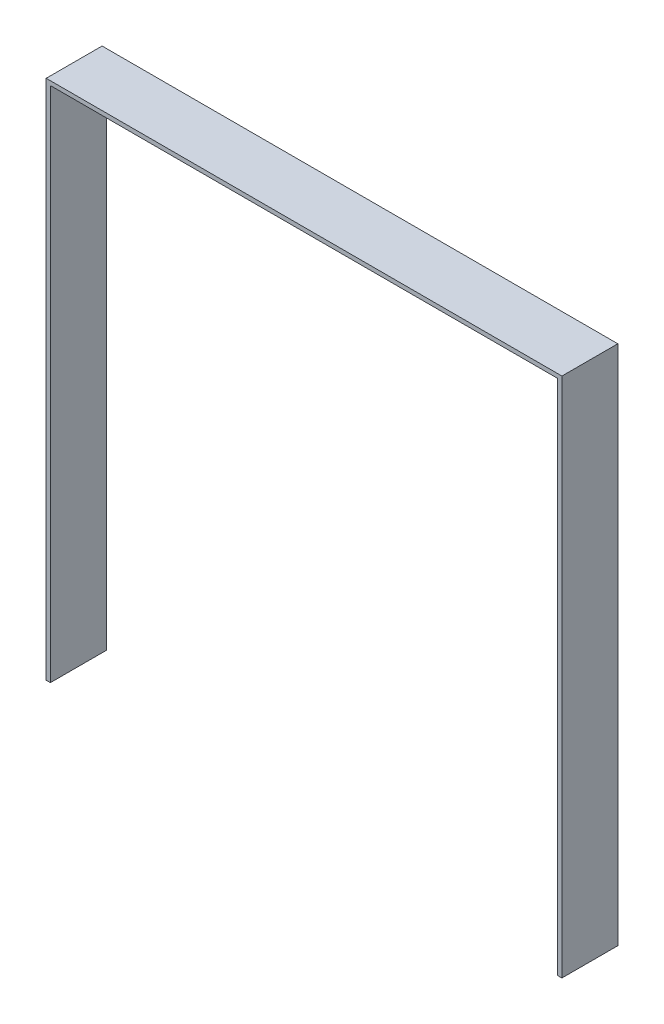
from build123d import *

# Parameters (mm, degrees)
BOSS_EXTRUDE1_DEPTH = 20


with BuildPart() as part:
    # Sketch1 → Boss-Extrude1 (new, symmetric)
    with BuildSketch(Plane.XY):
        Polygon((-184.5, 186.5), (184.5, 186.5), (184.5, -186.5), (181.5, -186.5), (181.5, 183.5), (-181.5, 183.5), (-181.5, -186.5), (-184.5, -186.5), align=None)
    extrude(amount=BOSS_EXTRUDE1_DEPTH, both=True)


solid = part.part
